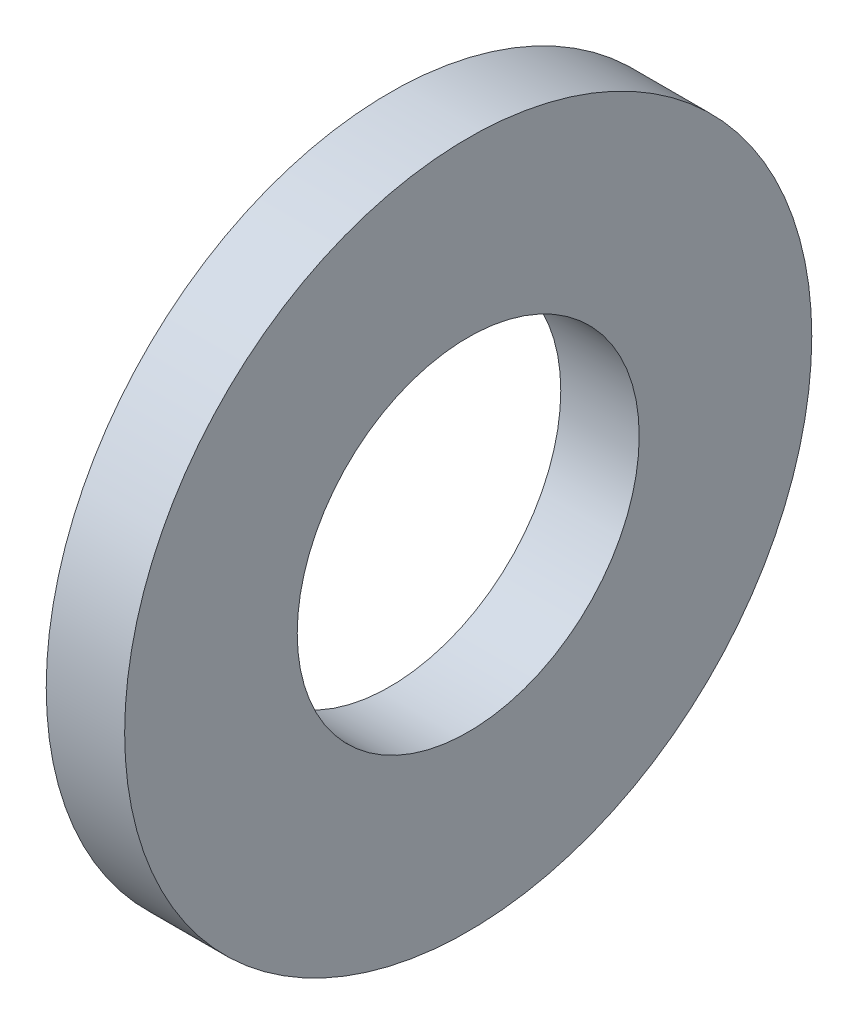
ISO-10303-21;
HEADER;
FILE_DESCRIPTION(('STEP AP214'),'2;1');
FILE_NAME('part.step','',(''),(''),'','','');
FILE_SCHEMA(('AUTOMOTIVE_DESIGN { 1 0 10303 214 1 1 1 1 }'));
ENDSEC;
DATA;
#1=APPLICATION_CONTEXT('core data for automotive mechanical design processes');
#2=APPLICATION_PROTOCOL_DEFINITION('international standard','automotive_design',2000,#1);
#3=PRODUCT_CONTEXT('',#1,'mechanical');
#4=PRODUCT('Part','Part','',(#3));
#5=PRODUCT_RELATED_PRODUCT_CATEGORY('part','',(#4));
#6=PRODUCT_DEFINITION_FORMATION('','',#4);
#7=PRODUCT_DEFINITION_CONTEXT('part definition',#1,'design');
#8=PRODUCT_DEFINITION('design','',#6,#7);
#9=PRODUCT_DEFINITION_SHAPE('','',#8);
#10=(LENGTH_UNIT() NAMED_UNIT(*) SI_UNIT(.MILLI.,.METRE.));
#11=(NAMED_UNIT(*) PLANE_ANGLE_UNIT() SI_UNIT($,.RADIAN.));
#12=(NAMED_UNIT(*) SI_UNIT($,.STERADIAN.) SOLID_ANGLE_UNIT());
#13=UNCERTAINTY_MEASURE_WITH_UNIT(LENGTH_MEASURE(1.E-05),#10,'distance_accuracy_value','');
#14=(GEOMETRIC_REPRESENTATION_CONTEXT(3) GLOBAL_UNCERTAINTY_ASSIGNED_CONTEXT((#13)) GLOBAL_UNIT_ASSIGNED_CONTEXT((#10,
#11,#12)) REPRESENTATION_CONTEXT('',''));
#15=CARTESIAN_POINT('',(0.,0.,0.));
#16=DIRECTION('',(0.,0.,1.));
#17=DIRECTION('',(1.,0.,0.));
#18=AXIS2_PLACEMENT_3D('',#15,#16,#17);
#19=CARTESIAN_POINT('',(-34.9249999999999,0.,0.));
#20=DIRECTION('',(-1.,0.,0.));
#21=DIRECTION('',(0.,0.,1.));
#22=AXIS2_PLACEMENT_3D('',#19,#20,#21);
#23=CYLINDRICAL_SURFACE('',#22,1.3843);
#24=CARTESIAN_POINT('',(0.,0.,0.));
#25=DIRECTION('',(-1.,0.,0.));
#26=DIRECTION('',(0.,0.,1.));
#27=AXIS2_PLACEMENT_3D('',#24,#25,#26);
#28=CIRCLE('',#27,1.3843);
#29=CARTESIAN_POINT('',(0.,0.,1.3843));
#30=VERTEX_POINT('',#29);
#31=EDGE_CURVE('E10',#30,#30,#28,.T.);
#32=ORIENTED_EDGE('',*,*,#31,.F.);
#33=EDGE_LOOP('',(#32));
#34=FACE_BOUND('',#33,.T.);
#35=CARTESIAN_POINT('',(-0.634999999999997,0.,0.));
#36=DIRECTION('',(-1.,0.,0.));
#37=DIRECTION('',(0.,0.,1.));
#38=AXIS2_PLACEMENT_3D('',#35,#36,#37);
#39=CIRCLE('',#38,1.3843);
#40=CARTESIAN_POINT('',(-0.634999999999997,0.,1.3843));
#41=VERTEX_POINT('',#40);
#42=EDGE_CURVE('E42',#41,#41,#39,.T.);
#43=ORIENTED_EDGE('',*,*,#42,.T.);
#44=EDGE_LOOP('',(#43));
#45=FACE_BOUND('',#44,.T.);
#46=ADVANCED_FACE('F28',(#34,#45),#23,.F.);
#47=CARTESIAN_POINT('',(0.,1.3843,0.));
#48=DIRECTION('',(-1.,0.,0.));
#49=DIRECTION('',(0.,0.,1.));
#50=AXIS2_PLACEMENT_3D('',#47,#48,#49);
#51=PLANE('',#50);
#52=CARTESIAN_POINT('',(0.,0.,0.));
#53=DIRECTION('',(-1.,0.,0.));
#54=DIRECTION('',(0.,0.,1.));
#55=AXIS2_PLACEMENT_3D('',#52,#53,#54);
#56=CIRCLE('',#55,2.7813);
#57=CARTESIAN_POINT('',(0.,0.,2.7813));
#58=VERTEX_POINT('',#57);
#59=EDGE_CURVE('E34',#58,#58,#56,.T.);
#60=ORIENTED_EDGE('',*,*,#59,.F.);
#61=EDGE_LOOP('',(#60));
#62=FACE_BOUND('',#61,.T.);
#63=ORIENTED_EDGE('',*,*,#31,.T.);
#64=EDGE_LOOP('',(#63));
#65=FACE_BOUND('',#64,.T.);
#66=ADVANCED_FACE('F57',(#62,#65),#51,.F.);
#67=CARTESIAN_POINT('',(-34.9249999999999,0.,0.));
#68=DIRECTION('',(-1.,0.,0.));
#69=DIRECTION('',(0.,0.,1.));
#70=AXIS2_PLACEMENT_3D('',#67,#68,#69);
#71=CYLINDRICAL_SURFACE('',#70,2.7813);
#72=CARTESIAN_POINT('',(-0.634999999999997,0.,0.));
#73=DIRECTION('',(-1.,0.,0.));
#74=DIRECTION('',(0.,0.,1.));
#75=AXIS2_PLACEMENT_3D('',#72,#73,#74);
#76=CIRCLE('',#75,2.7813);
#77=CARTESIAN_POINT('',(-0.634999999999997,0.,2.7813));
#78=VERTEX_POINT('',#77);
#79=EDGE_CURVE('E38',#78,#78,#76,.T.);
#80=ORIENTED_EDGE('',*,*,#79,.F.);
#81=EDGE_LOOP('',(#80));
#82=FACE_BOUND('',#81,.T.);
#83=ORIENTED_EDGE('',*,*,#59,.T.);
#84=EDGE_LOOP('',(#83));
#85=FACE_BOUND('',#84,.T.);
#86=ADVANCED_FACE('F52',(#82,#85),#71,.T.);
#87=CARTESIAN_POINT('',(-0.634999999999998,2.7813,0.));
#88=DIRECTION('',(1.,0.,0.));
#89=DIRECTION('',(0.,0.,-1.));
#90=AXIS2_PLACEMENT_3D('',#87,#88,#89);
#91=PLANE('',#90);
#92=ORIENTED_EDGE('',*,*,#42,.F.);
#93=EDGE_LOOP('',(#92));
#94=FACE_BOUND('',#93,.T.);
#95=ORIENTED_EDGE('',*,*,#79,.T.);
#96=EDGE_LOOP('',(#95));
#97=FACE_BOUND('',#96,.T.);
#98=ADVANCED_FACE('F49',(#94,#97),#91,.F.);
#99=CLOSED_SHELL('',(#46,#66,#86,#98));
#100=MANIFOLD_SOLID_BREP('B2',#99);
#101=ADVANCED_BREP_SHAPE_REPRESENTATION('',(#18,#100),#14);
#102=SHAPE_DEFINITION_REPRESENTATION(#9,#101);
ENDSEC;
END-ISO-10303-21;
